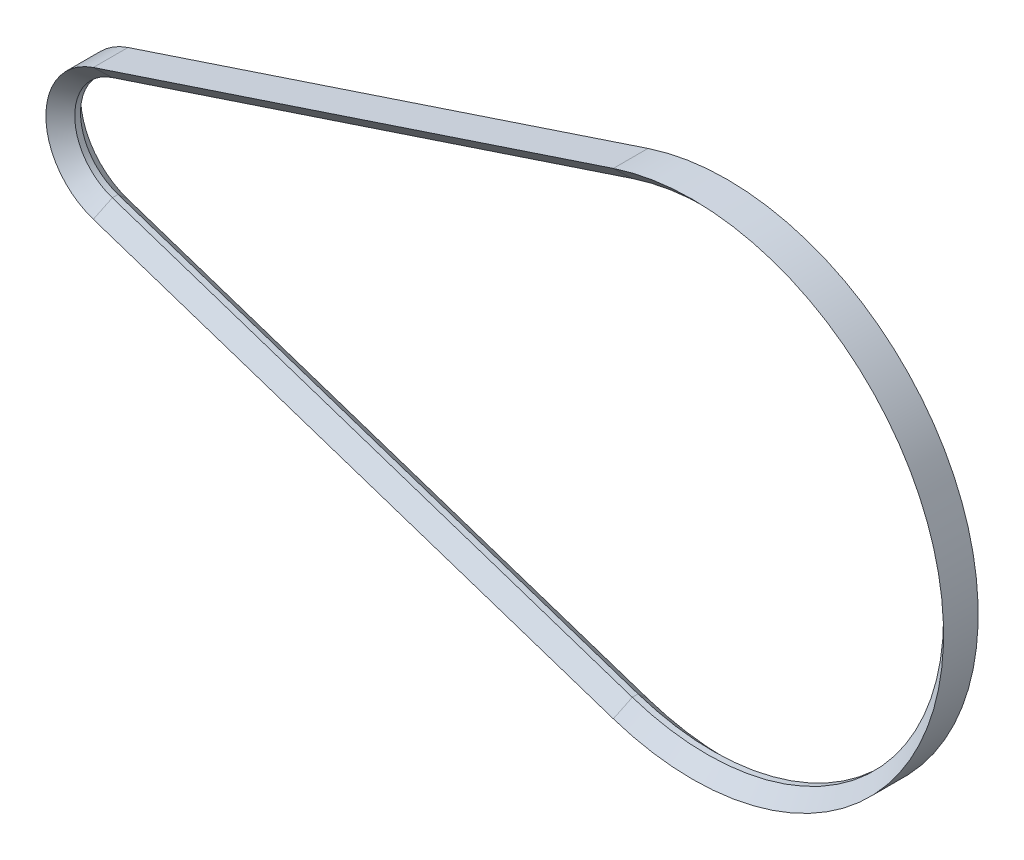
ISO-10303-21;
HEADER;
FILE_DESCRIPTION(('STEP AP214'),'2;1');
FILE_NAME('part.step','',(''),(''),'','','');
FILE_SCHEMA(('AUTOMOTIVE_DESIGN { 1 0 10303 214 1 1 1 1 }'));
ENDSEC;
DATA;
#1=APPLICATION_CONTEXT('core data for automotive mechanical design processes');
#2=APPLICATION_PROTOCOL_DEFINITION('international standard','automotive_design',2000,#1);
#3=PRODUCT_CONTEXT('',#1,'mechanical');
#4=PRODUCT('Part','Part','',(#3));
#5=PRODUCT_RELATED_PRODUCT_CATEGORY('part','',(#4));
#6=PRODUCT_DEFINITION_FORMATION('','',#4);
#7=PRODUCT_DEFINITION_CONTEXT('part definition',#1,'design');
#8=PRODUCT_DEFINITION('design','',#6,#7);
#9=PRODUCT_DEFINITION_SHAPE('','',#8);
#10=(LENGTH_UNIT() NAMED_UNIT(*) SI_UNIT(.MILLI.,.METRE.));
#11=(NAMED_UNIT(*) PLANE_ANGLE_UNIT() SI_UNIT($,.RADIAN.));
#12=(NAMED_UNIT(*) SI_UNIT($,.STERADIAN.) SOLID_ANGLE_UNIT());
#13=UNCERTAINTY_MEASURE_WITH_UNIT(LENGTH_MEASURE(1.E-05),#10,'distance_accuracy_value','');
#14=(GEOMETRIC_REPRESENTATION_CONTEXT(3) GLOBAL_UNCERTAINTY_ASSIGNED_CONTEXT((#13)) GLOBAL_UNIT_ASSIGNED_CONTEXT((#10,
#11,#12)) REPRESENTATION_CONTEXT('',''));
#15=CARTESIAN_POINT('',(0.,0.,0.));
#16=DIRECTION('',(0.,0.,1.));
#17=DIRECTION('',(1.,0.,0.));
#18=AXIS2_PLACEMENT_3D('',#15,#16,#17);
#19=CARTESIAN_POINT('',(86.2974999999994,41.2854876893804,3.));
#20=DIRECTION('',(-0.222738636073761,0.671109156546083,-0.707106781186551));
#21=DIRECTION('',(0.,0.725328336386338,0.688403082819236));
#22=AXIS2_PLACEMENT_3D('',#19,#20,#21);
#23=PLANE('',#22);
#24=DIRECTION('',(0.222738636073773,-0.671109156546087,-0.707106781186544));
#25=VECTOR('',#24,1.);
#26=CARTESIAN_POINT('',(86.2974999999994,41.2854876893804,3.));
#27=LINE('',#26,#25);
#28=CARTESIAN_POINT('',(86.2974999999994,41.2854876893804,3.));
#29=VERTEX_POINT('',#28);
#30=CARTESIAN_POINT('',(87.0849999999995,38.9127585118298,0.500000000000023));
#31=VERTEX_POINT('',#30);
#32=EDGE_CURVE('E161',#29,#31,#27,.T.);
#33=ORIENTED_EDGE('',*,*,#32,.F.);
#34=DIRECTION('',(-0.949091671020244,-0.315,0.));
#35=VECTOR('',#34,1.);
#36=CARTESIAN_POINT('',(86.2974999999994,41.2854876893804,3.));
#37=LINE('',#36,#35);
#38=CARTESIAN_POINT('',(-3.78000000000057,11.3891000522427,3.));
#39=VERTEX_POINT('',#38);
#40=EDGE_CURVE('E39',#29,#39,#37,.T.);
#41=ORIENTED_EDGE('',*,*,#40,.T.);
#42=DIRECTION('',(0.222738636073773,-0.671109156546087,-0.707106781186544));
#43=VECTOR('',#42,1.);
#44=CARTESIAN_POINT('',(-3.78000000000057,11.3891000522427,3.));
#45=LINE('',#44,#43);
#46=CARTESIAN_POINT('',(-2.99250000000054,9.01637087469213,0.500000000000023));
#47=VERTEX_POINT('',#46);
#48=EDGE_CURVE('E182',#39,#47,#45,.T.);
#49=ORIENTED_EDGE('',*,*,#48,.T.);
#50=DIRECTION('',(-0.949091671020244,-0.315,0.));
#51=VECTOR('',#50,1.);
#52=CARTESIAN_POINT('',(87.0849999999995,38.9127585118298,0.500000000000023));
#53=LINE('',#52,#51);
#54=EDGE_CURVE('E11',#31,#47,#53,.T.);
#55=ORIENTED_EDGE('',*,*,#54,.F.);
#56=EDGE_LOOP('',(#33,#41,#49,#55));
#57=FACE_BOUND('',#56,.T.);
#58=ADVANCED_FACE('F31',(#57),#23,.F.);
#59=CARTESIAN_POINT('',(86.2974999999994,41.2854876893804,3.));
#60=DIRECTION('',(0.315,-0.949091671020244,0.));
#61=DIRECTION('',(0.949091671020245,0.315,0.));
#62=AXIS2_PLACEMENT_3D('',#59,#60,#61);
#63=PLANE('',#62);
#64=DIRECTION('',(0.,0.,1.));
#65=VECTOR('',#64,1.);
#66=CARTESIAN_POINT('',(86.2974999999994,41.2854876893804,3.));
#67=LINE('',#66,#65);
#68=CARTESIAN_POINT('',(86.2974999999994,41.2854876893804,-3.));
#69=VERTEX_POINT('',#68);
#70=EDGE_CURVE('E158',#69,#29,#67,.T.);
#71=ORIENTED_EDGE('',*,*,#70,.F.);
#72=DIRECTION('',(-0.949091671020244,-0.315,0.));
#73=VECTOR('',#72,1.);
#74=CARTESIAN_POINT('',(86.2974999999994,41.2854876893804,-3.));
#75=LINE('',#74,#73);
#76=CARTESIAN_POINT('',(-3.78000000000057,11.3891000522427,-3.));
#77=VERTEX_POINT('',#76);
#78=EDGE_CURVE('E188',#69,#77,#75,.T.);
#79=ORIENTED_EDGE('',*,*,#78,.T.);
#80=DIRECTION('',(0.,0.,1.));
#81=VECTOR('',#80,1.);
#82=CARTESIAN_POINT('',(-3.78000000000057,11.3891000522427,3.));
#83=LINE('',#82,#81);
#84=EDGE_CURVE('E179',#77,#39,#83,.T.);
#85=ORIENTED_EDGE('',*,*,#84,.T.);
#86=ORIENTED_EDGE('',*,*,#40,.F.);
#87=EDGE_LOOP('',(#71,#79,#85,#86));
#88=FACE_BOUND('',#87,.T.);
#89=ADVANCED_FACE('F207',(#88),#63,.F.);
#90=CARTESIAN_POINT('',(86.2974999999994,41.2854876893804,-3.));
#91=DIRECTION('',(-0.222738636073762,0.671109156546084,0.70710678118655));
#92=DIRECTION('',(0.,-0.725328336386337,0.688403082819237));
#93=AXIS2_PLACEMENT_3D('',#90,#91,#92);
#94=PLANE('',#93);
#95=DIRECTION('',(-0.222738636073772,0.671109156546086,-0.707106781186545));
#96=VECTOR('',#95,1.);
#97=CARTESIAN_POINT('',(86.2974999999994,41.2854876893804,-3.));
#98=LINE('',#97,#96);
#99=CARTESIAN_POINT('',(87.0849999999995,38.9127585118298,-0.500000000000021));
#100=VERTEX_POINT('',#99);
#101=EDGE_CURVE('E155',#100,#69,#98,.T.);
#102=ORIENTED_EDGE('',*,*,#101,.F.);
#103=DIRECTION('',(-0.949091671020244,-0.315,0.));
#104=VECTOR('',#103,1.);
#105=CARTESIAN_POINT('',(87.0849999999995,38.9127585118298,-0.500000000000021));
#106=LINE('',#105,#104);
#107=CARTESIAN_POINT('',(-2.99250000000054,9.01637087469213,-0.500000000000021));
#108=VERTEX_POINT('',#107);
#109=EDGE_CURVE('E185',#100,#108,#106,.T.);
#110=ORIENTED_EDGE('',*,*,#109,.T.);
#111=DIRECTION('',(-0.222738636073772,0.671109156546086,-0.707106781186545));
#112=VECTOR('',#111,1.);
#113=CARTESIAN_POINT('',(-3.78000000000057,11.3891000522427,-3.));
#114=LINE('',#113,#112);
#115=EDGE_CURVE('E127',#108,#77,#114,.T.);
#116=ORIENTED_EDGE('',*,*,#115,.T.);
#117=ORIENTED_EDGE('',*,*,#78,.F.);
#118=EDGE_LOOP('',(#102,#110,#116,#117));
#119=FACE_BOUND('',#118,.T.);
#120=ADVANCED_FACE('F205',(#119),#94,.F.);
#121=CARTESIAN_POINT('',(87.0849999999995,38.9127585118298,-0.500000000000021));
#122=DIRECTION('',(-0.315,0.949091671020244,0.));
#123=DIRECTION('',(-0.949091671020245,-0.315,0.));
#124=AXIS2_PLACEMENT_3D('',#121,#122,#123);
#125=PLANE('',#124);
#126=DIRECTION('',(0.,0.,-1.));
#127=VECTOR('',#126,1.);
#128=CARTESIAN_POINT('',(87.0849999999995,38.9127585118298,-0.500000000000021));
#129=LINE('',#128,#127);
#130=EDGE_CURVE('E152',#31,#100,#129,.T.);
#131=ORIENTED_EDGE('',*,*,#130,.F.);
#132=ORIENTED_EDGE('',*,*,#54,.T.);
#133=DIRECTION('',(0.,0.,-1.));
#134=VECTOR('',#133,1.);
#135=CARTESIAN_POINT('',(-2.99250000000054,9.01637087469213,-0.500000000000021));
#136=LINE('',#135,#134);
#137=EDGE_CURVE('E176',#47,#108,#136,.T.);
#138=ORIENTED_EDGE('',*,*,#137,.T.);
#139=ORIENTED_EDGE('',*,*,#109,.F.);
#140=EDGE_LOOP('',(#131,#132,#138,#139));
#141=FACE_BOUND('',#140,.T.);
#142=ADVANCED_FACE('F225',(#141),#125,.F.);
#143=CARTESIAN_POINT('',(100.,0.,3.));
#144=DIRECTION('',(0.,0.,1.));
#145=DIRECTION('',(1.,0.,0.));
#146=AXIS2_PLACEMENT_3D('',#143,#144,#145);
#147=CONICAL_SURFACE('',#146,43.5,0.785398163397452);
#148=DIRECTION('',(0.222738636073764,0.67110915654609,-0.707106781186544));
#149=VECTOR('',#148,1.);
#150=CARTESIAN_POINT('',(86.2975,-41.2854876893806,3.));
#151=LINE('',#150,#149);
#152=CARTESIAN_POINT('',(86.2975,-41.2854876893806,3.));
#153=VERTEX_POINT('',#152);
#154=CARTESIAN_POINT('',(87.085,-38.91275851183,0.500000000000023));
#155=VERTEX_POINT('',#154);
#156=EDGE_CURVE('E112',#153,#155,#151,.T.);
#157=ORIENTED_EDGE('',*,*,#156,.F.);
#158=CARTESIAN_POINT('',(100.,0.,3.));
#159=DIRECTION('',(0.,0.,1.));
#160=DIRECTION('',(1.,0.,0.));
#161=AXIS2_PLACEMENT_3D('',#158,#159,#160);
#162=CIRCLE('',#161,43.5);
#163=EDGE_CURVE('E170',#153,#29,#162,.T.);
#164=ORIENTED_EDGE('',*,*,#163,.T.);
#165=ORIENTED_EDGE('',*,*,#32,.T.);
#166=CARTESIAN_POINT('',(100.,0.,0.500000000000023));
#167=DIRECTION('',(0.,0.,1.));
#168=DIRECTION('',(1.,0.,0.));
#169=AXIS2_PLACEMENT_3D('',#166,#167,#168);
#170=CIRCLE('',#169,41.);
#171=EDGE_CURVE('E173',#155,#31,#170,.T.);
#172=ORIENTED_EDGE('',*,*,#171,.F.);
#173=EDGE_LOOP('',(#157,#164,#165,#172));
#174=FACE_BOUND('',#173,.T.);
#175=ADVANCED_FACE('F228',(#174),#147,.F.);
#176=CARTESIAN_POINT('',(100.,0.,0.));
#177=DIRECTION('',(0.,0.,1.));
#178=DIRECTION('',(1.,0.,0.));
#179=AXIS2_PLACEMENT_3D('',#176,#177,#178);
#180=CYLINDRICAL_SURFACE('',#179,43.5);
#181=DIRECTION('',(0.,0.,1.));
#182=VECTOR('',#181,1.);
#183=CARTESIAN_POINT('',(86.2975,-41.2854876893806,3.));
#184=LINE('',#183,#182);
#185=CARTESIAN_POINT('',(86.2975,-41.2854876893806,-3.));
#186=VERTEX_POINT('',#185);
#187=EDGE_CURVE('E141',#186,#153,#184,.T.);
#188=ORIENTED_EDGE('',*,*,#187,.F.);
#189=CARTESIAN_POINT('',(100.,0.,-3.));
#190=DIRECTION('',(0.,0.,1.));
#191=DIRECTION('',(1.,0.,0.));
#192=AXIS2_PLACEMENT_3D('',#189,#190,#191);
#193=CIRCLE('',#192,43.5);
#194=EDGE_CURVE('E167',#186,#69,#193,.T.);
#195=ORIENTED_EDGE('',*,*,#194,.T.);
#196=ORIENTED_EDGE('',*,*,#70,.T.);
#197=ORIENTED_EDGE('',*,*,#163,.F.);
#198=EDGE_LOOP('',(#188,#195,#196,#197));
#199=FACE_BOUND('',#198,.T.);
#200=ADVANCED_FACE('F214',(#199),#180,.T.);
#201=CARTESIAN_POINT('',(100.,0.,-0.500000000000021));
#202=DIRECTION('',(0.,0.,-1.));
#203=DIRECTION('',(-1.,0.,0.));
#204=AXIS2_PLACEMENT_3D('',#201,#202,#203);
#205=CONICAL_SURFACE('',#204,41.,0.785398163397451);
#206=DIRECTION('',(-0.222738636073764,-0.671109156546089,-0.707106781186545));
#207=VECTOR('',#206,1.);
#208=CARTESIAN_POINT('',(86.2975,-41.2854876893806,-3.));
#209=LINE('',#208,#207);
#210=CARTESIAN_POINT('',(87.085,-38.91275851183,-0.500000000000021));
#211=VERTEX_POINT('',#210);
#212=EDGE_CURVE('E139',#211,#186,#209,.T.);
#213=ORIENTED_EDGE('',*,*,#212,.F.);
#214=CARTESIAN_POINT('',(100.,0.,-0.500000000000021));
#215=DIRECTION('',(0.,0.,1.));
#216=DIRECTION('',(1.,0.,0.));
#217=AXIS2_PLACEMENT_3D('',#214,#215,#216);
#218=CIRCLE('',#217,41.);
#219=EDGE_CURVE('E164',#211,#100,#218,.T.);
#220=ORIENTED_EDGE('',*,*,#219,.T.);
#221=ORIENTED_EDGE('',*,*,#101,.T.);
#222=ORIENTED_EDGE('',*,*,#194,.F.);
#223=EDGE_LOOP('',(#213,#220,#221,#222));
#224=FACE_BOUND('',#223,.T.);
#225=ADVANCED_FACE('F212',(#224),#205,.F.);
#226=CARTESIAN_POINT('',(100.,0.,0.));
#227=DIRECTION('',(0.,0.,1.));
#228=DIRECTION('',(1.,0.,0.));
#229=AXIS2_PLACEMENT_3D('',#226,#227,#228);
#230=CYLINDRICAL_SURFACE('',#229,41.);
#231=DIRECTION('',(0.,0.,-1.));
#232=VECTOR('',#231,1.);
#233=CARTESIAN_POINT('',(87.085,-38.91275851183,-0.500000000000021));
#234=LINE('',#233,#232);
#235=EDGE_CURVE('E108',#155,#211,#234,.T.);
#236=ORIENTED_EDGE('',*,*,#235,.F.);
#237=ORIENTED_EDGE('',*,*,#171,.T.);
#238=ORIENTED_EDGE('',*,*,#130,.T.);
#239=ORIENTED_EDGE('',*,*,#219,.F.);
#240=EDGE_LOOP('',(#236,#237,#238,#239));
#241=FACE_BOUND('',#240,.T.);
#242=ADVANCED_FACE('F229',(#241),#230,.F.);
#243=CARTESIAN_POINT('',(-3.78000000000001,-11.3891000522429,3.));
#244=DIRECTION('',(-0.222738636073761,-0.671109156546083,-0.707106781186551));
#245=DIRECTION('',(0.,0.725328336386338,-0.688403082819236));
#246=AXIS2_PLACEMENT_3D('',#243,#244,#245);
#247=PLANE('',#246);
#248=DIRECTION('',(0.222738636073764,0.67110915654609,-0.707106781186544));
#249=VECTOR('',#248,1.);
#250=CARTESIAN_POINT('',(-3.78000000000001,-11.3891000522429,3.));
#251=LINE('',#250,#249);
#252=CARTESIAN_POINT('',(-3.78000000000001,-11.3891000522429,3.));
#253=VERTEX_POINT('',#252);
#254=CARTESIAN_POINT('',(-2.9925,-9.01637087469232,0.500000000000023));
#255=VERTEX_POINT('',#254);
#256=EDGE_CURVE('E136',#253,#255,#251,.T.);
#257=ORIENTED_EDGE('',*,*,#256,.F.);
#258=DIRECTION('',(0.949091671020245,-0.315,0.));
#259=VECTOR('',#258,1.);
#260=CARTESIAN_POINT('',(-3.78000000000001,-11.3891000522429,3.));
#261=LINE('',#260,#259);
#262=EDGE_CURVE('E147',#253,#153,#261,.T.);
#263=ORIENTED_EDGE('',*,*,#262,.T.);
#264=ORIENTED_EDGE('',*,*,#156,.T.);
#265=DIRECTION('',(0.949091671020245,-0.315,0.));
#266=VECTOR('',#265,1.);
#267=CARTESIAN_POINT('',(-2.9925,-9.01637087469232,0.500000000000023));
#268=LINE('',#267,#266);
#269=EDGE_CURVE('E150',#255,#155,#268,.T.);
#270=ORIENTED_EDGE('',*,*,#269,.F.);
#271=EDGE_LOOP('',(#257,#263,#264,#270));
#272=FACE_BOUND('',#271,.T.);
#273=ADVANCED_FACE('F220',(#272),#247,.F.);
#274=CARTESIAN_POINT('',(-3.78000000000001,-11.3891000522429,3.));
#275=DIRECTION('',(0.315,0.949091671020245,0.));
#276=DIRECTION('',(-0.949091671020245,0.315,0.));
#277=AXIS2_PLACEMENT_3D('',#274,#275,#276);
#278=PLANE('',#277);
#279=DIRECTION('',(0.,0.,1.));
#280=VECTOR('',#279,1.);
#281=CARTESIAN_POINT('',(-3.78000000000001,-11.3891000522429,3.));
#282=LINE('',#281,#280);
#283=CARTESIAN_POINT('',(-3.78000000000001,-11.3891000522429,-3.));
#284=VERTEX_POINT('',#283);
#285=EDGE_CURVE('E121',#284,#253,#282,.T.);
#286=ORIENTED_EDGE('',*,*,#285,.F.);
#287=DIRECTION('',(0.949091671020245,-0.315,0.));
#288=VECTOR('',#287,1.);
#289=CARTESIAN_POINT('',(-3.78000000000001,-11.3891000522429,-3.));
#290=LINE('',#289,#288);
#291=EDGE_CURVE('E111',#284,#186,#290,.T.);
#292=ORIENTED_EDGE('',*,*,#291,.T.);
#293=ORIENTED_EDGE('',*,*,#187,.T.);
#294=ORIENTED_EDGE('',*,*,#262,.F.);
#295=EDGE_LOOP('',(#286,#292,#293,#294));
#296=FACE_BOUND('',#295,.T.);
#297=ADVANCED_FACE('F217',(#296),#278,.F.);
#298=CARTESIAN_POINT('',(-3.78000000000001,-11.3891000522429,-3.));
#299=DIRECTION('',(-0.222738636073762,-0.671109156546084,0.70710678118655));
#300=DIRECTION('',(0.,-0.725328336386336,-0.688403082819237));
#301=AXIS2_PLACEMENT_3D('',#298,#299,#300);
#302=PLANE('',#301);
#303=DIRECTION('',(-0.222738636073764,-0.671109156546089,-0.707106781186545));
#304=VECTOR('',#303,1.);
#305=CARTESIAN_POINT('',(-3.78000000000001,-11.3891000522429,-3.));
#306=LINE('',#305,#304);
#307=CARTESIAN_POINT('',(-2.99250000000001,-9.01637087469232,-0.500000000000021));
#308=VERTEX_POINT('',#307);
#309=EDGE_CURVE('E115',#308,#284,#306,.T.);
#310=ORIENTED_EDGE('',*,*,#309,.F.);
#311=DIRECTION('',(0.949091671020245,-0.315,0.));
#312=VECTOR('',#311,1.);
#313=CARTESIAN_POINT('',(-2.99250000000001,-9.01637087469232,-0.500000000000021));
#314=LINE('',#313,#312);
#315=EDGE_CURVE('E101',#308,#211,#314,.T.);
#316=ORIENTED_EDGE('',*,*,#315,.T.);
#317=ORIENTED_EDGE('',*,*,#212,.T.);
#318=ORIENTED_EDGE('',*,*,#291,.F.);
#319=EDGE_LOOP('',(#310,#316,#317,#318));
#320=FACE_BOUND('',#319,.T.);
#321=ADVANCED_FACE('F117',(#320),#302,.F.);
#322=CARTESIAN_POINT('',(-2.99250000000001,-9.01637087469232,-0.500000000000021));
#323=DIRECTION('',(-0.315,-0.949091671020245,0.));
#324=DIRECTION('',(0.949091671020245,-0.315,0.));
#325=AXIS2_PLACEMENT_3D('',#322,#323,#324);
#326=PLANE('',#325);
#327=DIRECTION('',(0.,0.,-1.));
#328=VECTOR('',#327,1.);
#329=CARTESIAN_POINT('',(-2.99250000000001,-9.01637087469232,-0.500000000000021));
#330=LINE('',#329,#328);
#331=EDGE_CURVE('E106',#255,#308,#330,.T.);
#332=ORIENTED_EDGE('',*,*,#331,.F.);
#333=ORIENTED_EDGE('',*,*,#269,.T.);
#334=ORIENTED_EDGE('',*,*,#235,.T.);
#335=ORIENTED_EDGE('',*,*,#315,.F.);
#336=EDGE_LOOP('',(#332,#333,#334,#335));
#337=FACE_BOUND('',#336,.T.);
#338=ADVANCED_FACE('F103',(#337),#326,.F.);
#339=CARTESIAN_POINT('',(0.,0.,0.));
#340=DIRECTION('',(0.,0.,-1.));
#341=DIRECTION('',(-1.,0.,0.));
#342=AXIS2_PLACEMENT_3D('',#339,#340,#341);
#343=CYLINDRICAL_SURFACE('',#342,9.5);
#344=CARTESIAN_POINT('',(0.,0.,-0.500000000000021));
#345=DIRECTION('',(0.,0.,-1.));
#346=DIRECTION('',(-1.,0.,0.));
#347=AXIS2_PLACEMENT_3D('',#344,#345,#346);
#348=CIRCLE('',#347,9.5);
#349=EDGE_CURVE('E124',#308,#108,#348,.T.);
#350=ORIENTED_EDGE('',*,*,#349,.T.);
#351=ORIENTED_EDGE('',*,*,#137,.F.);
#352=CARTESIAN_POINT('',(0.,0.,0.500000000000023));
#353=DIRECTION('',(0.,0.,-1.));
#354=DIRECTION('',(-1.,0.,0.));
#355=AXIS2_PLACEMENT_3D('',#352,#353,#354);
#356=CIRCLE('',#355,9.5);
#357=EDGE_CURVE('E47',#255,#47,#356,.T.);
#358=ORIENTED_EDGE('',*,*,#357,.F.);
#359=ORIENTED_EDGE('',*,*,#331,.T.);
#360=EDGE_LOOP('',(#350,#351,#358,#359));
#361=FACE_BOUND('',#360,.T.);
#362=ADVANCED_FACE('F132',(#361),#343,.F.);
#363=CARTESIAN_POINT('',(0.,0.,-0.500000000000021));
#364=DIRECTION('',(0.,0.,-1.));
#365=DIRECTION('',(-1.,0.,0.));
#366=AXIS2_PLACEMENT_3D('',#363,#364,#365);
#367=CONICAL_SURFACE('',#366,9.5,0.785398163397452);
#368=CARTESIAN_POINT('',(0.,0.,-3.));
#369=DIRECTION('',(0.,0.,-1.));
#370=DIRECTION('',(-1.,0.,0.));
#371=AXIS2_PLACEMENT_3D('',#368,#369,#370);
#372=CIRCLE('',#371,12.);
#373=EDGE_CURVE('E130',#284,#77,#372,.T.);
#374=ORIENTED_EDGE('',*,*,#373,.T.);
#375=ORIENTED_EDGE('',*,*,#115,.F.);
#376=ORIENTED_EDGE('',*,*,#349,.F.);
#377=ORIENTED_EDGE('',*,*,#309,.T.);
#378=EDGE_LOOP('',(#374,#375,#376,#377));
#379=FACE_BOUND('',#378,.T.);
#380=ADVANCED_FACE('F125',(#379),#367,.F.);
#381=CARTESIAN_POINT('',(0.,0.,0.));
#382=DIRECTION('',(0.,0.,-1.));
#383=DIRECTION('',(-1.,0.,0.));
#384=AXIS2_PLACEMENT_3D('',#381,#382,#383);
#385=CYLINDRICAL_SURFACE('',#384,12.);
#386=CARTESIAN_POINT('',(0.,0.,3.));
#387=DIRECTION('',(0.,0.,-1.));
#388=DIRECTION('',(-1.,0.,0.));
#389=AXIS2_PLACEMENT_3D('',#386,#387,#388);
#390=CIRCLE('',#389,12.);
#391=EDGE_CURVE('E55',#253,#39,#390,.T.);
#392=ORIENTED_EDGE('',*,*,#391,.T.);
#393=ORIENTED_EDGE('',*,*,#84,.F.);
#394=ORIENTED_EDGE('',*,*,#373,.F.);
#395=ORIENTED_EDGE('',*,*,#285,.T.);
#396=EDGE_LOOP('',(#392,#393,#394,#395));
#397=FACE_BOUND('',#396,.T.);
#398=ADVANCED_FACE('F201',(#397),#385,.T.);
#399=CARTESIAN_POINT('',(0.,0.,3.));
#400=DIRECTION('',(0.,0.,1.));
#401=DIRECTION('',(1.,0.,0.));
#402=AXIS2_PLACEMENT_3D('',#399,#400,#401);
#403=CONICAL_SURFACE('',#402,12.,0.785398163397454);
#404=ORIENTED_EDGE('',*,*,#256,.T.);
#405=ORIENTED_EDGE('',*,*,#357,.T.);
#406=ORIENTED_EDGE('',*,*,#48,.F.);
#407=ORIENTED_EDGE('',*,*,#391,.F.);
#408=EDGE_LOOP('',(#404,#405,#406,#407));
#409=FACE_BOUND('',#408,.T.);
#410=ADVANCED_FACE('F221',(#409),#403,.F.);
#411=CLOSED_SHELL('',(#58,#89,#120,#142,#175,#200,#225,#242,#273,#297,#321,#338,#362,#380,#398,#410));
#412=MANIFOLD_SOLID_BREP('B2',#411);
#413=ADVANCED_BREP_SHAPE_REPRESENTATION('',(#18,#412),#14);
#414=SHAPE_DEFINITION_REPRESENTATION(#9,#413);
ENDSEC;
END-ISO-10303-21;
